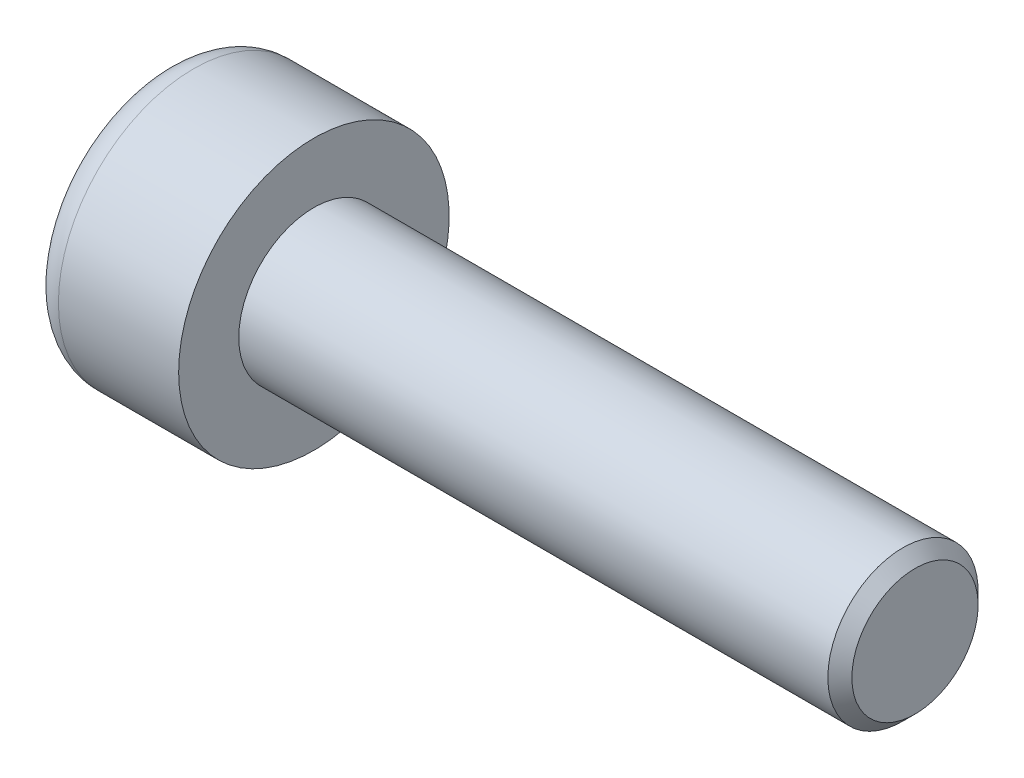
ISO-10303-21;
HEADER;
FILE_DESCRIPTION(('STEP AP214'),'2;1');
FILE_NAME('part.step','',(''),(''),'','','');
FILE_SCHEMA(('AUTOMOTIVE_DESIGN { 1 0 10303 214 1 1 1 1 }'));
ENDSEC;
DATA;
#1=APPLICATION_CONTEXT('core data for automotive mechanical design processes');
#2=APPLICATION_PROTOCOL_DEFINITION('international standard','automotive_design',2000,#1);
#3=PRODUCT_CONTEXT('',#1,'mechanical');
#4=PRODUCT('Part','Part','',(#3));
#5=PRODUCT_RELATED_PRODUCT_CATEGORY('part','',(#4));
#6=PRODUCT_DEFINITION_FORMATION('','',#4);
#7=PRODUCT_DEFINITION_CONTEXT('part definition',#1,'design');
#8=PRODUCT_DEFINITION('design','',#6,#7);
#9=PRODUCT_DEFINITION_SHAPE('','',#8);
#10=(LENGTH_UNIT() NAMED_UNIT(*) SI_UNIT(.MILLI.,.METRE.));
#11=(NAMED_UNIT(*) PLANE_ANGLE_UNIT() SI_UNIT($,.RADIAN.));
#12=(NAMED_UNIT(*) SI_UNIT($,.STERADIAN.) SOLID_ANGLE_UNIT());
#13=UNCERTAINTY_MEASURE_WITH_UNIT(LENGTH_MEASURE(1.E-05),#10,'distance_accuracy_value','');
#14=(GEOMETRIC_REPRESENTATION_CONTEXT(3) GLOBAL_UNCERTAINTY_ASSIGNED_CONTEXT((#13)) GLOBAL_UNIT_ASSIGNED_CONTEXT((#10,
#11,#12)) REPRESENTATION_CONTEXT('',''));
#15=CARTESIAN_POINT('',(0.,0.,0.));
#16=DIRECTION('',(0.,0.,1.));
#17=DIRECTION('',(1.,0.,0.));
#18=AXIS2_PLACEMENT_3D('',#15,#16,#17);
#19=CARTESIAN_POINT('',(10.,1.25,0.));
#20=DIRECTION('',(-1.,0.,0.));
#21=DIRECTION('',(0.,0.,1.));
#22=AXIS2_PLACEMENT_3D('',#19,#20,#21);
#23=PLANE('',#22);
#24=CARTESIAN_POINT('',(10.,0.,0.));
#25=DIRECTION('',(-1.,0.,0.));
#26=DIRECTION('',(0.,0.,1.));
#27=AXIS2_PLACEMENT_3D('',#24,#25,#26);
#28=CIRCLE('',#27,1.05000000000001);
#29=CARTESIAN_POINT('',(10.,0.,1.05000000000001));
#30=VERTEX_POINT('',#29);
#31=EDGE_CURVE('E147',#30,#30,#28,.F.);
#32=ORIENTED_EDGE('',*,*,#31,.T.);
#33=EDGE_LOOP('',(#32));
#34=FACE_BOUND('',#33,.T.);
#35=ADVANCED_FACE('F30',(#34),#23,.F.);
#36=CARTESIAN_POINT('',(-28.9826848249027,0.,0.));
#37=DIRECTION('',(-1.,0.,0.));
#38=DIRECTION('',(0.,0.,1.));
#39=AXIS2_PLACEMENT_3D('',#36,#37,#38);
#40=CYLINDRICAL_SURFACE('',#39,1.25);
#41=CARTESIAN_POINT('',(9.8,0.,0.));
#42=DIRECTION('',(-1.,0.,0.));
#43=DIRECTION('',(0.,0.,1.));
#44=AXIS2_PLACEMENT_3D('',#41,#42,#43);
#45=CIRCLE('',#44,1.25);
#46=CARTESIAN_POINT('',(9.8,0.,1.25));
#47=VERTEX_POINT('',#46);
#48=EDGE_CURVE('E144',#47,#47,#45,.T.);
#49=ORIENTED_EDGE('',*,*,#48,.T.);
#50=EDGE_LOOP('',(#49));
#51=FACE_BOUND('',#50,.T.);
#52=CARTESIAN_POINT('',(0.,0.,0.));
#53=DIRECTION('',(-1.,0.,0.));
#54=DIRECTION('',(0.,0.,1.));
#55=AXIS2_PLACEMENT_3D('',#52,#53,#54);
#56=CIRCLE('',#55,1.25);
#57=CARTESIAN_POINT('',(0.,0.,1.25));
#58=VERTEX_POINT('',#57);
#59=EDGE_CURVE('E141',#58,#58,#56,.T.);
#60=ORIENTED_EDGE('',*,*,#59,.F.);
#61=EDGE_LOOP('',(#60));
#62=FACE_BOUND('',#61,.T.);
#63=ADVANCED_FACE('F168',(#51,#62),#40,.T.);
#64=CARTESIAN_POINT('',(0.,2.25,0.));
#65=DIRECTION('',(-1.,0.,0.));
#66=DIRECTION('',(0.,0.,1.));
#67=AXIS2_PLACEMENT_3D('',#64,#65,#66);
#68=PLANE('',#67);
#69=CARTESIAN_POINT('',(0.,0.,0.));
#70=DIRECTION('',(-1.,0.,0.));
#71=DIRECTION('',(0.,0.,1.));
#72=AXIS2_PLACEMENT_3D('',#69,#70,#71);
#73=CIRCLE('',#72,2.25);
#74=CARTESIAN_POINT('',(0.,0.,2.25));
#75=VERTEX_POINT('',#74);
#76=EDGE_CURVE('E132',#75,#75,#73,.T.);
#77=ORIENTED_EDGE('',*,*,#76,.F.);
#78=EDGE_LOOP('',(#77));
#79=FACE_BOUND('',#78,.T.);
#80=ORIENTED_EDGE('',*,*,#59,.T.);
#81=EDGE_LOOP('',(#80));
#82=FACE_BOUND('',#81,.T.);
#83=ADVANCED_FACE('F173',(#79,#82),#68,.F.);
#84=CARTESIAN_POINT('',(-28.9826848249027,0.,0.));
#85=DIRECTION('',(-1.,0.,0.));
#86=DIRECTION('',(0.,0.,1.));
#87=AXIS2_PLACEMENT_3D('',#84,#85,#86);
#88=CYLINDRICAL_SURFACE('',#87,2.25);
#89=CARTESIAN_POINT('',(-2.,0.,0.));
#90=DIRECTION('',(1.,0.,0.));
#91=DIRECTION('',(0.,0.,-1.));
#92=AXIS2_PLACEMENT_3D('',#89,#90,#91);
#93=CIRCLE('',#92,2.25);
#94=CARTESIAN_POINT('',(-2.,0.,-2.25));
#95=VERTEX_POINT('',#94);
#96=EDGE_CURVE('E11',#95,#95,#93,.T.);
#97=ORIENTED_EDGE('',*,*,#96,.T.);
#98=EDGE_LOOP('',(#97));
#99=FACE_BOUND('',#98,.T.);
#100=ORIENTED_EDGE('',*,*,#76,.T.);
#101=EDGE_LOOP('',(#100));
#102=FACE_BOUND('',#101,.T.);
#103=ADVANCED_FACE('F182',(#99,#102),#88,.T.);
#104=CARTESIAN_POINT('',(-2.5,0.,0.));
#105=DIRECTION('',(1.,0.,0.));
#106=DIRECTION('',(0.,0.,-1.));
#107=AXIS2_PLACEMENT_3D('',#104,#105,#106);
#108=PLANE('',#107);
#109=DIRECTION('',(0.,0.86602540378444,-0.499999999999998));
#110=VECTOR('',#109,1.);
#111=CARTESIAN_POINT('',(-2.5,1.,0.577350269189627));
#112=LINE('',#111,#110);
#113=CARTESIAN_POINT('',(-2.5,0.,1.15470053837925));
#114=VERTEX_POINT('',#113);
#115=CARTESIAN_POINT('',(-2.5,1.,0.577350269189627));
#116=VERTEX_POINT('',#115);
#117=EDGE_CURVE('E98',#114,#116,#112,.T.);
#118=ORIENTED_EDGE('',*,*,#117,.F.);
#119=DIRECTION('',(0.,0.86602540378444,0.499999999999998));
#120=VECTOR('',#119,1.);
#121=CARTESIAN_POINT('',(-2.5,0.,1.15470053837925));
#122=LINE('',#121,#120);
#123=CARTESIAN_POINT('',(-2.5,-1.,0.577350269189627));
#124=VERTEX_POINT('',#123);
#125=EDGE_CURVE('E44',#124,#114,#122,.T.);
#126=ORIENTED_EDGE('',*,*,#125,.F.);
#127=DIRECTION('',(0.,0.,1.));
#128=VECTOR('',#127,1.);
#129=CARTESIAN_POINT('',(-2.5,-1.,0.577350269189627));
#130=LINE('',#129,#128);
#131=CARTESIAN_POINT('',(-2.5,-1.,-0.577350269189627));
#132=VERTEX_POINT('',#131);
#133=EDGE_CURVE('E114',#132,#124,#130,.T.);
#134=ORIENTED_EDGE('',*,*,#133,.F.);
#135=DIRECTION('',(0.,-0.86602540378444,0.499999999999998));
#136=VECTOR('',#135,1.);
#137=CARTESIAN_POINT('',(-2.5,-1.,-0.577350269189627));
#138=LINE('',#137,#136);
#139=CARTESIAN_POINT('',(-2.5,0.,-1.15470053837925));
#140=VERTEX_POINT('',#139);
#141=EDGE_CURVE('E108',#140,#132,#138,.T.);
#142=ORIENTED_EDGE('',*,*,#141,.F.);
#143=DIRECTION('',(0.,-0.86602540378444,-0.499999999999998));
#144=VECTOR('',#143,1.);
#145=CARTESIAN_POINT('',(-2.5,0.,-1.15470053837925));
#146=LINE('',#145,#144);
#147=CARTESIAN_POINT('',(-2.5,1.,-0.577350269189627));
#148=VERTEX_POINT('',#147);
#149=EDGE_CURVE('E106',#148,#140,#146,.T.);
#150=ORIENTED_EDGE('',*,*,#149,.F.);
#151=DIRECTION('',(0.,0.,-1.));
#152=VECTOR('',#151,1.);
#153=CARTESIAN_POINT('',(-2.5,1.,-0.577350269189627));
#154=LINE('',#153,#152);
#155=EDGE_CURVE('E87',#116,#148,#154,.T.);
#156=ORIENTED_EDGE('',*,*,#155,.F.);
#157=EDGE_LOOP('',(#118,#126,#134,#142,#150,#156));
#158=FACE_BOUND('',#157,.T.);
#159=CARTESIAN_POINT('',(-2.5,0.,0.));
#160=DIRECTION('',(1.,0.,0.));
#161=DIRECTION('',(0.,0.,-1.));
#162=AXIS2_PLACEMENT_3D('',#159,#160,#161);
#163=CIRCLE('',#162,1.75);
#164=CARTESIAN_POINT('',(-2.5,0.,-1.75));
#165=VERTEX_POINT('',#164);
#166=EDGE_CURVE('E37',#165,#165,#163,.F.);
#167=ORIENTED_EDGE('',*,*,#166,.T.);
#168=EDGE_LOOP('',(#167));
#169=FACE_BOUND('',#168,.T.);
#170=ADVANCED_FACE('F102',(#158,#169),#108,.F.);
#171=CARTESIAN_POINT('',(9.8,0.,0.));
#172=DIRECTION('',(-1.,0.,0.));
#173=DIRECTION('',(0.,0.,1.));
#174=AXIS2_PLACEMENT_3D('',#171,#172,#173);
#175=CONICAL_SURFACE('',#174,1.25,0.785398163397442);
#176=ORIENTED_EDGE('',*,*,#31,.F.);
#177=EDGE_LOOP('',(#176));
#178=FACE_BOUND('',#177,.T.);
#179=ORIENTED_EDGE('',*,*,#48,.F.);
#180=EDGE_LOOP('',(#179));
#181=FACE_BOUND('',#180,.T.);
#182=ADVANCED_FACE('F155',(#178,#181),#175,.T.);
#183=CARTESIAN_POINT('',(-2.,0.,0.));
#184=DIRECTION('',(1.,0.,0.));
#185=DIRECTION('',(0.,0.,-1.));
#186=AXIS2_PLACEMENT_3D('',#183,#184,#185);
#187=TOROIDAL_SURFACE('',#186,1.75,0.5);
#188=ORIENTED_EDGE('',*,*,#96,.F.);
#189=EDGE_LOOP('',(#188));
#190=FACE_BOUND('',#189,.T.);
#191=ORIENTED_EDGE('',*,*,#166,.F.);
#192=EDGE_LOOP('',(#191));
#193=FACE_BOUND('',#192,.T.);
#194=ADVANCED_FACE('F152',(#190,#193),#187,.T.);
#195=CARTESIAN_POINT('',(0.,0.,1.15470053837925));
#196=DIRECTION('',(0.,-0.499999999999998,0.86602540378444));
#197=DIRECTION('',(0.,-0.86602540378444,-0.499999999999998));
#198=AXIS2_PLACEMENT_3D('',#195,#196,#197);
#199=PLANE('',#198);
#200=ORIENTED_EDGE('',*,*,#125,.T.);
#201=DIRECTION('',(-1.,0.,0.));
#202=VECTOR('',#201,1.);
#203=CARTESIAN_POINT('',(0.,0.,1.15470053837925));
#204=LINE('',#203,#202);
#205=CARTESIAN_POINT('',(0.,0.,1.15470053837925));
#206=VERTEX_POINT('',#205);
#207=EDGE_CURVE('E95',#206,#114,#204,.T.);
#208=ORIENTED_EDGE('',*,*,#207,.F.);
#209=DIRECTION('',(0.,0.86602540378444,0.499999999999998));
#210=VECTOR('',#209,1.);
#211=CARTESIAN_POINT('',(0.,0.,1.15470053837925));
#212=LINE('',#211,#210);
#213=CARTESIAN_POINT('',(0.,-1.,0.577350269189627));
#214=VERTEX_POINT('',#213);
#215=EDGE_CURVE('E116',#214,#206,#212,.T.);
#216=ORIENTED_EDGE('',*,*,#215,.F.);
#217=DIRECTION('',(-1.,0.,0.));
#218=VECTOR('',#217,1.);
#219=CARTESIAN_POINT('',(0.,-1.,0.577350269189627));
#220=LINE('',#219,#218);
#221=EDGE_CURVE('E51',#214,#124,#220,.T.);
#222=ORIENTED_EDGE('',*,*,#221,.T.);
#223=EDGE_LOOP('',(#200,#208,#216,#222));
#224=FACE_BOUND('',#223,.T.);
#225=ADVANCED_FACE('F154',(#224),#199,.F.);
#226=CARTESIAN_POINT('',(0.,-1.,0.577350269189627));
#227=DIRECTION('',(0.,-1.,0.));
#228=DIRECTION('',(0.,0.,-1.));
#229=AXIS2_PLACEMENT_3D('',#226,#227,#228);
#230=PLANE('',#229);
#231=ORIENTED_EDGE('',*,*,#133,.T.);
#232=ORIENTED_EDGE('',*,*,#221,.F.);
#233=DIRECTION('',(0.,0.,1.));
#234=VECTOR('',#233,1.);
#235=CARTESIAN_POINT('',(0.,-1.,0.577350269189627));
#236=LINE('',#235,#234);
#237=CARTESIAN_POINT('',(0.,-1.,-0.577350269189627));
#238=VERTEX_POINT('',#237);
#239=EDGE_CURVE('E128',#238,#214,#236,.T.);
#240=ORIENTED_EDGE('',*,*,#239,.F.);
#241=DIRECTION('',(-1.,0.,0.));
#242=VECTOR('',#241,1.);
#243=CARTESIAN_POINT('',(0.,-1.,-0.577350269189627));
#244=LINE('',#243,#242);
#245=EDGE_CURVE('E133',#238,#132,#244,.T.);
#246=ORIENTED_EDGE('',*,*,#245,.T.);
#247=EDGE_LOOP('',(#231,#232,#240,#246));
#248=FACE_BOUND('',#247,.T.);
#249=ADVANCED_FACE('F162',(#248),#230,.F.);
#250=CARTESIAN_POINT('',(0.,-1.,-0.577350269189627));
#251=DIRECTION('',(0.,-0.499999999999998,-0.86602540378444));
#252=DIRECTION('',(0.,0.86602540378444,-0.499999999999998));
#253=AXIS2_PLACEMENT_3D('',#250,#251,#252);
#254=PLANE('',#253);
#255=ORIENTED_EDGE('',*,*,#141,.T.);
#256=ORIENTED_EDGE('',*,*,#245,.F.);
#257=DIRECTION('',(0.,-0.86602540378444,0.499999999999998));
#258=VECTOR('',#257,1.);
#259=CARTESIAN_POINT('',(0.,-1.,-0.577350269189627));
#260=LINE('',#259,#258);
#261=CARTESIAN_POINT('',(0.,0.,-1.15470053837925));
#262=VERTEX_POINT('',#261);
#263=EDGE_CURVE('E125',#262,#238,#260,.T.);
#264=ORIENTED_EDGE('',*,*,#263,.F.);
#265=DIRECTION('',(-1.,0.,0.));
#266=VECTOR('',#265,1.);
#267=CARTESIAN_POINT('',(0.,0.,-1.15470053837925));
#268=LINE('',#267,#266);
#269=EDGE_CURVE('E135',#262,#140,#268,.T.);
#270=ORIENTED_EDGE('',*,*,#269,.T.);
#271=EDGE_LOOP('',(#255,#256,#264,#270));
#272=FACE_BOUND('',#271,.T.);
#273=ADVANCED_FACE('F228',(#272),#254,.F.);
#274=CARTESIAN_POINT('',(0.,0.,-1.15470053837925));
#275=DIRECTION('',(0.,0.499999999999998,-0.86602540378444));
#276=DIRECTION('',(0.,0.86602540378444,0.499999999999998));
#277=AXIS2_PLACEMENT_3D('',#274,#275,#276);
#278=PLANE('',#277);
#279=ORIENTED_EDGE('',*,*,#149,.T.);
#280=ORIENTED_EDGE('',*,*,#269,.F.);
#281=DIRECTION('',(0.,-0.86602540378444,-0.499999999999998));
#282=VECTOR('',#281,1.);
#283=CARTESIAN_POINT('',(0.,0.,-1.15470053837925));
#284=LINE('',#283,#282);
#285=CARTESIAN_POINT('',(0.,1.,-0.577350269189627));
#286=VERTEX_POINT('',#285);
#287=EDGE_CURVE('E122',#286,#262,#284,.T.);
#288=ORIENTED_EDGE('',*,*,#287,.F.);
#289=DIRECTION('',(-1.,0.,0.));
#290=VECTOR('',#289,1.);
#291=CARTESIAN_POINT('',(0.,1.,-0.577350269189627));
#292=LINE('',#291,#290);
#293=EDGE_CURVE('E94',#286,#148,#292,.T.);
#294=ORIENTED_EDGE('',*,*,#293,.T.);
#295=EDGE_LOOP('',(#279,#280,#288,#294));
#296=FACE_BOUND('',#295,.T.);
#297=ADVANCED_FACE('F236',(#296),#278,.F.);
#298=CARTESIAN_POINT('',(0.,1.,-0.577350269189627));
#299=DIRECTION('',(0.,1.,0.));
#300=DIRECTION('',(0.,0.,1.));
#301=AXIS2_PLACEMENT_3D('',#298,#299,#300);
#302=PLANE('',#301);
#303=ORIENTED_EDGE('',*,*,#155,.T.);
#304=ORIENTED_EDGE('',*,*,#293,.F.);
#305=DIRECTION('',(0.,0.,-1.));
#306=VECTOR('',#305,1.);
#307=CARTESIAN_POINT('',(0.,1.,-0.577350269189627));
#308=LINE('',#307,#306);
#309=CARTESIAN_POINT('',(0.,1.,0.577350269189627));
#310=VERTEX_POINT('',#309);
#311=EDGE_CURVE('E90',#310,#286,#308,.T.);
#312=ORIENTED_EDGE('',*,*,#311,.F.);
#313=DIRECTION('',(-1.,0.,0.));
#314=VECTOR('',#313,1.);
#315=CARTESIAN_POINT('',(0.,1.,0.577350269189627));
#316=LINE('',#315,#314);
#317=EDGE_CURVE('E83',#310,#116,#316,.T.);
#318=ORIENTED_EDGE('',*,*,#317,.T.);
#319=EDGE_LOOP('',(#303,#304,#312,#318));
#320=FACE_BOUND('',#319,.T.);
#321=ADVANCED_FACE('F85',(#320),#302,.F.);
#322=CARTESIAN_POINT('',(0.,1.,0.577350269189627));
#323=DIRECTION('',(0.,0.499999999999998,0.86602540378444));
#324=DIRECTION('',(0.,-0.86602540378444,0.499999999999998));
#325=AXIS2_PLACEMENT_3D('',#322,#323,#324);
#326=PLANE('',#325);
#327=ORIENTED_EDGE('',*,*,#117,.T.);
#328=ORIENTED_EDGE('',*,*,#317,.F.);
#329=DIRECTION('',(0.,0.86602540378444,-0.499999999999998));
#330=VECTOR('',#329,1.);
#331=CARTESIAN_POINT('',(0.,1.,0.577350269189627));
#332=LINE('',#331,#330);
#333=EDGE_CURVE('E119',#206,#310,#332,.T.);
#334=ORIENTED_EDGE('',*,*,#333,.F.);
#335=ORIENTED_EDGE('',*,*,#207,.T.);
#336=EDGE_LOOP('',(#327,#328,#334,#335));
#337=FACE_BOUND('',#336,.T.);
#338=ADVANCED_FACE('F99',(#337),#326,.F.);
#339=CARTESIAN_POINT('',(0.,-1.,0.577350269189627));
#340=DIRECTION('',(1.,0.,0.));
#341=DIRECTION('',(0.,0.,-1.));
#342=AXIS2_PLACEMENT_3D('',#339,#340,#341);
#343=PLANE('',#342);
#344=ORIENTED_EDGE('',*,*,#215,.T.);
#345=ORIENTED_EDGE('',*,*,#333,.T.);
#346=ORIENTED_EDGE('',*,*,#311,.T.);
#347=ORIENTED_EDGE('',*,*,#287,.T.);
#348=ORIENTED_EDGE('',*,*,#263,.T.);
#349=ORIENTED_EDGE('',*,*,#239,.T.);
#350=EDGE_LOOP('',(#344,#345,#346,#347,#348,#349));
#351=FACE_BOUND('',#350,.T.);
#352=ADVANCED_FACE('F260',(#351),#343,.F.);
#353=CLOSED_SHELL('',(#35,#63,#83,#103,#170,#182,#194,#225,#249,#273,#297,#321,#338,#352));
#354=MANIFOLD_SOLID_BREP('B2',#353);
#355=ADVANCED_BREP_SHAPE_REPRESENTATION('',(#18,#354),#14);
#356=SHAPE_DEFINITION_REPRESENTATION(#9,#355);
ENDSEC;
END-ISO-10303-21;
